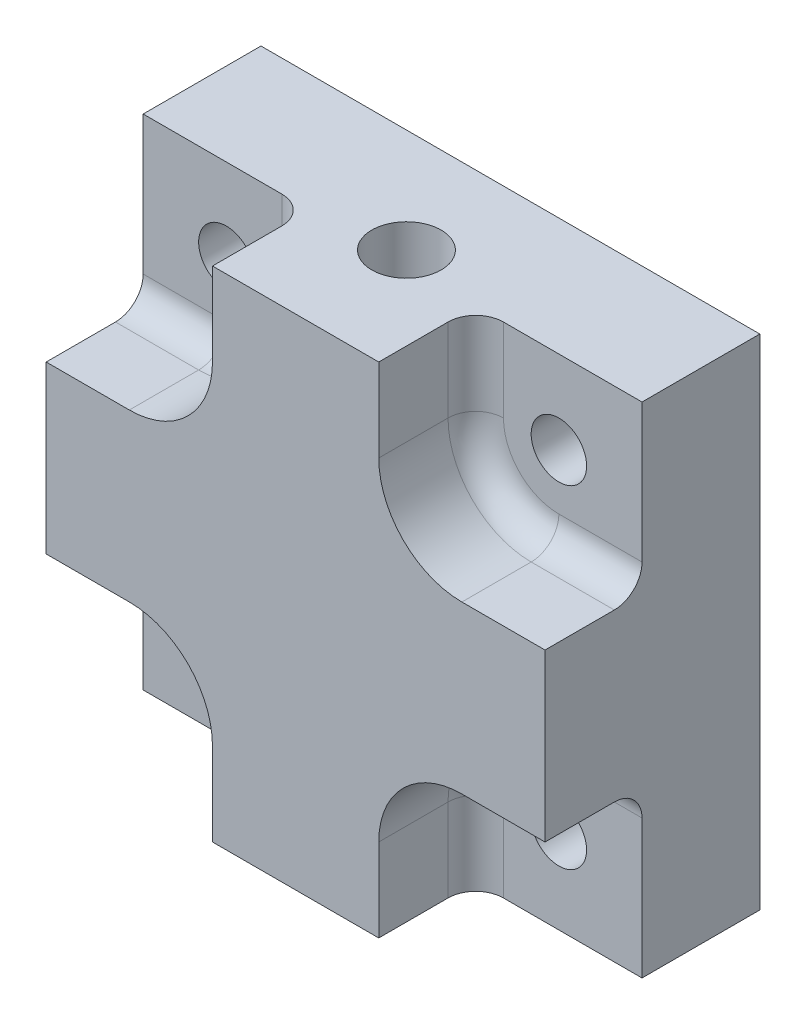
ISO-10303-21;
HEADER;
FILE_DESCRIPTION(('STEP AP214'),'2;1');
FILE_NAME('part.step','',(''),(''),'','','');
FILE_SCHEMA(('AUTOMOTIVE_DESIGN { 1 0 10303 214 1 1 1 1 }'));
ENDSEC;
DATA;
#1=APPLICATION_CONTEXT('core data for automotive mechanical design processes');
#2=APPLICATION_PROTOCOL_DEFINITION('international standard','automotive_design',2000,#1);
#3=PRODUCT_CONTEXT('',#1,'mechanical');
#4=PRODUCT('Part','Part','',(#3));
#5=PRODUCT_RELATED_PRODUCT_CATEGORY('part','',(#4));
#6=PRODUCT_DEFINITION_FORMATION('','',#4);
#7=PRODUCT_DEFINITION_CONTEXT('part definition',#1,'design');
#8=PRODUCT_DEFINITION('design','',#6,#7);
#9=PRODUCT_DEFINITION_SHAPE('','',#8);
#10=(LENGTH_UNIT() NAMED_UNIT(*) SI_UNIT(.MILLI.,.METRE.));
#11=(NAMED_UNIT(*) PLANE_ANGLE_UNIT() SI_UNIT($,.RADIAN.));
#12=(NAMED_UNIT(*) SI_UNIT($,.STERADIAN.) SOLID_ANGLE_UNIT());
#13=UNCERTAINTY_MEASURE_WITH_UNIT(LENGTH_MEASURE(1.E-05),#10,'distance_accuracy_value','');
#14=(GEOMETRIC_REPRESENTATION_CONTEXT(3) GLOBAL_UNCERTAINTY_ASSIGNED_CONTEXT((#13)) GLOBAL_UNIT_ASSIGNED_CONTEXT((#10,
#11,#12)) REPRESENTATION_CONTEXT('',''));
#15=CARTESIAN_POINT('',(0.,0.,0.));
#16=DIRECTION('',(0.,0.,1.));
#17=DIRECTION('',(1.,0.,0.));
#18=AXIS2_PLACEMENT_3D('',#15,#16,#17);
#19=CARTESIAN_POINT('',(-18.,-18.,15.5));
#20=DIRECTION('',(0.,0.,1.));
#21=DIRECTION('',(1.,0.,0.));
#22=AXIS2_PLACEMENT_3D('',#19,#20,#21);
#23=PLANE('',#22);
#24=DIRECTION('',(-1.,0.,0.));
#25=VECTOR('',#24,1.);
#26=CARTESIAN_POINT('',(12.,-6.,15.5));
#27=LINE('',#26,#25);
#28=CARTESIAN_POINT('',(18.,-6.,15.5));
#29=VERTEX_POINT('',#28);
#30=CARTESIAN_POINT('',(12.,-6.,15.5));
#31=VERTEX_POINT('',#30);
#32=EDGE_CURVE('E266',#29,#31,#27,.T.);
#33=ORIENTED_EDGE('',*,*,#32,.F.);
#34=DIRECTION('',(0.,1.,0.));
#35=VECTOR('',#34,1.);
#36=CARTESIAN_POINT('',(18.,18.,15.5));
#37=LINE('',#36,#35);
#38=CARTESIAN_POINT('',(18.,6.,15.5));
#39=VERTEX_POINT('',#38);
#40=EDGE_CURVE('E382',#29,#39,#37,.T.);
#41=ORIENTED_EDGE('',*,*,#40,.T.);
#42=DIRECTION('',(1.,0.,0.));
#43=VECTOR('',#42,1.);
#44=CARTESIAN_POINT('',(12.,6.,15.5));
#45=LINE('',#44,#43);
#46=CARTESIAN_POINT('',(12.,6.,15.5));
#47=VERTEX_POINT('',#46);
#48=EDGE_CURVE('E332',#47,#39,#45,.T.);
#49=ORIENTED_EDGE('',*,*,#48,.F.);
#50=CARTESIAN_POINT('',(12.,12.,15.5));
#51=DIRECTION('',(0.,0.,1.));
#52=DIRECTION('',(1.,0.,0.));
#53=AXIS2_PLACEMENT_3D('',#50,#51,#52);
#54=CIRCLE('',#53,6.);
#55=CARTESIAN_POINT('',(6.,12.,15.5));
#56=VERTEX_POINT('',#55);
#57=EDGE_CURVE('E329',#56,#47,#54,.T.);
#58=ORIENTED_EDGE('',*,*,#57,.F.);
#59=DIRECTION('',(0.,-1.,0.));
#60=VECTOR('',#59,1.);
#61=CARTESIAN_POINT('',(6.,12.,15.5));
#62=LINE('',#61,#60);
#63=CARTESIAN_POINT('',(6.,18.,15.5));
#64=VERTEX_POINT('',#63);
#65=EDGE_CURVE('E335',#64,#56,#62,.T.);
#66=ORIENTED_EDGE('',*,*,#65,.F.);
#67=DIRECTION('',(-1.,0.,0.));
#68=VECTOR('',#67,1.);
#69=CARTESIAN_POINT('',(-18.,18.,15.5));
#70=LINE('',#69,#68);
#71=CARTESIAN_POINT('',(-6.,18.,15.5));
#72=VERTEX_POINT('',#71);
#73=EDGE_CURVE('E385',#64,#72,#70,.T.);
#74=ORIENTED_EDGE('',*,*,#73,.T.);
#75=DIRECTION('',(0.,1.,0.));
#76=VECTOR('',#75,1.);
#77=CARTESIAN_POINT('',(-6.,12.,15.5));
#78=LINE('',#77,#76);
#79=CARTESIAN_POINT('',(-6.,12.,15.5));
#80=VERTEX_POINT('',#79);
#81=EDGE_CURVE('E309',#80,#72,#78,.T.);
#82=ORIENTED_EDGE('',*,*,#81,.F.);
#83=CARTESIAN_POINT('',(-12.,12.,15.5));
#84=DIRECTION('',(0.,0.,1.));
#85=DIRECTION('',(-1.,0.,0.));
#86=AXIS2_PLACEMENT_3D('',#83,#84,#85);
#87=CIRCLE('',#86,6.);
#88=CARTESIAN_POINT('',(-12.,6.00000000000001,15.5));
#89=VERTEX_POINT('',#88);
#90=EDGE_CURVE('E306',#89,#80,#87,.T.);
#91=ORIENTED_EDGE('',*,*,#90,.F.);
#92=DIRECTION('',(1.,0.,0.));
#93=VECTOR('',#92,1.);
#94=CARTESIAN_POINT('',(-12.,6.00000000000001,15.5));
#95=LINE('',#94,#93);
#96=CARTESIAN_POINT('',(-18.,6.00000000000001,15.5));
#97=VERTEX_POINT('',#96);
#98=EDGE_CURVE('E312',#97,#89,#95,.T.);
#99=ORIENTED_EDGE('',*,*,#98,.F.);
#100=DIRECTION('',(0.,-1.,0.));
#101=VECTOR('',#100,1.);
#102=CARTESIAN_POINT('',(-18.,18.,15.5));
#103=LINE('',#102,#101);
#104=CARTESIAN_POINT('',(-18.,-6.00000000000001,15.5));
#105=VERTEX_POINT('',#104);
#106=EDGE_CURVE('E376',#97,#105,#103,.T.);
#107=ORIENTED_EDGE('',*,*,#106,.T.);
#108=DIRECTION('',(-1.,0.,0.));
#109=VECTOR('',#108,1.);
#110=CARTESIAN_POINT('',(-12.,-6.00000000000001,15.5));
#111=LINE('',#110,#109);
#112=CARTESIAN_POINT('',(-12.,-6.00000000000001,15.5));
#113=VERTEX_POINT('',#112);
#114=EDGE_CURVE('E286',#113,#105,#111,.T.);
#115=ORIENTED_EDGE('',*,*,#114,.F.);
#116=CARTESIAN_POINT('',(-12.,-12.,15.5));
#117=DIRECTION('',(0.,0.,1.));
#118=DIRECTION('',(1.,0.,0.));
#119=AXIS2_PLACEMENT_3D('',#116,#117,#118);
#120=CIRCLE('',#119,6.);
#121=CARTESIAN_POINT('',(-6.,-12.,15.5));
#122=VERTEX_POINT('',#121);
#123=EDGE_CURVE('E283',#122,#113,#120,.T.);
#124=ORIENTED_EDGE('',*,*,#123,.F.);
#125=DIRECTION('',(0.,1.,0.));
#126=VECTOR('',#125,1.);
#127=CARTESIAN_POINT('',(-6.,-12.,15.5));
#128=LINE('',#127,#126);
#129=CARTESIAN_POINT('',(-6.,-18.,15.5));
#130=VERTEX_POINT('',#129);
#131=EDGE_CURVE('E289',#130,#122,#128,.T.);
#132=ORIENTED_EDGE('',*,*,#131,.F.);
#133=DIRECTION('',(1.,0.,0.));
#134=VECTOR('',#133,1.);
#135=CARTESIAN_POINT('',(-18.,-18.,15.5));
#136=LINE('',#135,#134);
#137=CARTESIAN_POINT('',(6.,-18.,15.5));
#138=VERTEX_POINT('',#137);
#139=EDGE_CURVE('E379',#130,#138,#136,.T.);
#140=ORIENTED_EDGE('',*,*,#139,.T.);
#141=DIRECTION('',(0.,-1.,0.));
#142=VECTOR('',#141,1.);
#143=CARTESIAN_POINT('',(6.,-12.,15.5));
#144=LINE('',#143,#142);
#145=CARTESIAN_POINT('',(6.,-12.,15.5));
#146=VERTEX_POINT('',#145);
#147=EDGE_CURVE('E263',#146,#138,#144,.T.);
#148=ORIENTED_EDGE('',*,*,#147,.F.);
#149=CARTESIAN_POINT('',(12.,-12.,15.5));
#150=DIRECTION('',(0.,0.,1.));
#151=DIRECTION('',(-1.,0.,0.));
#152=AXIS2_PLACEMENT_3D('',#149,#150,#151);
#153=CIRCLE('',#152,6.);
#154=EDGE_CURVE('E260',#31,#146,#153,.T.);
#155=ORIENTED_EDGE('',*,*,#154,.F.);
#156=EDGE_LOOP('',(#33,#41,#49,#58,#66,#74,#82,#91,#99,#107,#115,#124,#132,#140,#148,#155));
#157=FACE_BOUND('',#156,.T.);
#158=ADVANCED_FACE('F26',(#157),#23,.T.);
#159=CARTESIAN_POINT('',(-12.,-12.,0.));
#160=DIRECTION('',(0.,0.,1.));
#161=DIRECTION('',(1.,0.,0.));
#162=AXIS2_PLACEMENT_3D('',#159,#160,#161);
#163=CYLINDRICAL_SURFACE('',#162,2.);
#164=CARTESIAN_POINT('',(-12.,-12.,0.));
#165=DIRECTION('',(0.,0.,1.));
#166=DIRECTION('',(1.,0.,0.));
#167=AXIS2_PLACEMENT_3D('',#164,#165,#166);
#168=CIRCLE('',#167,2.);
#169=CARTESIAN_POINT('',(-10.,-12.,0.));
#170=VERTEX_POINT('',#169);
#171=EDGE_CURVE('E355',#170,#170,#168,.T.);
#172=ORIENTED_EDGE('',*,*,#171,.F.);
#173=EDGE_LOOP('',(#172));
#174=FACE_BOUND('',#173,.T.);
#175=CARTESIAN_POINT('',(-12.,-12.,8.5));
#176=DIRECTION('',(0.,0.,1.));
#177=DIRECTION('',(1.,0.,0.));
#178=AXIS2_PLACEMENT_3D('',#175,#176,#177);
#179=CIRCLE('',#178,2.);
#180=CARTESIAN_POINT('',(-10.,-12.,8.5));
#181=VERTEX_POINT('',#180);
#182=EDGE_CURVE('E300',#181,#181,#179,.F.);
#183=ORIENTED_EDGE('',*,*,#182,.F.);
#184=EDGE_LOOP('',(#183));
#185=FACE_BOUND('',#184,.T.);
#186=ADVANCED_FACE('F608',(#174,#185),#163,.F.);
#187=CARTESIAN_POINT('',(12.,12.,0.));
#188=DIRECTION('',(0.,0.,1.));
#189=DIRECTION('',(1.,0.,0.));
#190=AXIS2_PLACEMENT_3D('',#187,#188,#189);
#191=CYLINDRICAL_SURFACE('',#190,2.);
#192=CARTESIAN_POINT('',(12.,12.,0.));
#193=DIRECTION('',(0.,0.,1.));
#194=DIRECTION('',(1.,0.,0.));
#195=AXIS2_PLACEMENT_3D('',#192,#193,#194);
#196=CIRCLE('',#195,2.);
#197=CARTESIAN_POINT('',(14.,12.,0.));
#198=VERTEX_POINT('',#197);
#199=EDGE_CURVE('E361',#198,#198,#196,.T.);
#200=ORIENTED_EDGE('',*,*,#199,.F.);
#201=EDGE_LOOP('',(#200));
#202=FACE_BOUND('',#201,.T.);
#203=CARTESIAN_POINT('',(12.,12.,8.5));
#204=DIRECTION('',(0.,0.,1.));
#205=DIRECTION('',(1.,0.,0.));
#206=AXIS2_PLACEMENT_3D('',#203,#204,#205);
#207=CIRCLE('',#206,2.);
#208=CARTESIAN_POINT('',(14.,12.,8.5));
#209=VERTEX_POINT('',#208);
#210=EDGE_CURVE('E346',#209,#209,#207,.F.);
#211=ORIENTED_EDGE('',*,*,#210,.F.);
#212=EDGE_LOOP('',(#211));
#213=FACE_BOUND('',#212,.T.);
#214=ADVANCED_FACE('F614',(#202,#213),#191,.F.);
#215=CARTESIAN_POINT('',(-18.,18.,15.5));
#216=DIRECTION('',(1.,0.,0.));
#217=DIRECTION('',(0.,1.,0.));
#218=AXIS2_PLACEMENT_3D('',#215,#216,#217);
#219=PLANE('',#218);
#220=DIRECTION('',(0.,-1.,0.));
#221=VECTOR('',#220,1.);
#222=CARTESIAN_POINT('',(-18.,-18.,8.5));
#223=LINE('',#222,#221);
#224=CARTESIAN_POINT('',(-18.,-8.00000000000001,8.5));
#225=VERTEX_POINT('',#224);
#226=CARTESIAN_POINT('',(-18.,-18.,8.5));
#227=VERTEX_POINT('',#226);
#228=EDGE_CURVE('E292',#225,#227,#223,.T.);
#229=ORIENTED_EDGE('',*,*,#228,.F.);
#230=CARTESIAN_POINT('',(-18.,-8.00000000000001,10.5));
#231=DIRECTION('',(1.,0.,0.));
#232=DIRECTION('',(0.,1.,0.));
#233=AXIS2_PLACEMENT_3D('',#230,#231,#232);
#234=CIRCLE('',#233,2.);
#235=CARTESIAN_POINT('',(-18.,-6.00000000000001,10.5));
#236=VERTEX_POINT('',#235);
#237=EDGE_CURVE('E459',#225,#236,#234,.T.);
#238=ORIENTED_EDGE('',*,*,#237,.T.);
#239=DIRECTION('',(0.,0.,1.));
#240=VECTOR('',#239,1.);
#241=CARTESIAN_POINT('',(-18.,-6.00000000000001,8.5));
#242=LINE('',#241,#240);
#243=EDGE_CURVE('E303',#236,#105,#242,.T.);
#244=ORIENTED_EDGE('',*,*,#243,.T.);
#245=ORIENTED_EDGE('',*,*,#106,.F.);
#246=DIRECTION('',(0.,0.,1.));
#247=VECTOR('',#246,1.);
#248=CARTESIAN_POINT('',(-18.,6.00000000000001,8.5));
#249=LINE('',#248,#247);
#250=CARTESIAN_POINT('',(-18.,6.00000000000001,10.5));
#251=VERTEX_POINT('',#250);
#252=EDGE_CURVE('E324',#251,#97,#249,.T.);
#253=ORIENTED_EDGE('',*,*,#252,.F.);
#254=CARTESIAN_POINT('',(-18.,8.00000000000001,10.5));
#255=DIRECTION('',(1.,0.,0.));
#256=DIRECTION('',(0.,1.,0.));
#257=AXIS2_PLACEMENT_3D('',#254,#255,#256);
#258=CIRCLE('',#257,2.);
#259=CARTESIAN_POINT('',(-18.,8.00000000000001,8.5));
#260=VERTEX_POINT('',#259);
#261=EDGE_CURVE('E465',#251,#260,#258,.T.);
#262=ORIENTED_EDGE('',*,*,#261,.T.);
#263=DIRECTION('',(0.,-1.,0.));
#264=VECTOR('',#263,1.);
#265=CARTESIAN_POINT('',(-18.,18.,8.5));
#266=LINE('',#265,#264);
#267=CARTESIAN_POINT('',(-18.,18.,8.5));
#268=VERTEX_POINT('',#267);
#269=EDGE_CURVE('E317',#268,#260,#266,.T.);
#270=ORIENTED_EDGE('',*,*,#269,.F.);
#271=DIRECTION('',(0.,0.,-1.));
#272=VECTOR('',#271,1.);
#273=CARTESIAN_POINT('',(-18.,18.,15.5));
#274=LINE('',#273,#272);
#275=CARTESIAN_POINT('',(-18.,18.,0.));
#276=VERTEX_POINT('',#275);
#277=EDGE_CURVE('E388',#268,#276,#274,.T.);
#278=ORIENTED_EDGE('',*,*,#277,.T.);
#279=DIRECTION('',(0.,-1.,0.));
#280=VECTOR('',#279,1.);
#281=CARTESIAN_POINT('',(-18.,18.,0.));
#282=LINE('',#281,#280);
#283=CARTESIAN_POINT('',(-18.,-18.,0.));
#284=VERTEX_POINT('',#283);
#285=EDGE_CURVE('E364',#276,#284,#282,.T.);
#286=ORIENTED_EDGE('',*,*,#285,.T.);
#287=DIRECTION('',(0.,0.,-1.));
#288=VECTOR('',#287,1.);
#289=CARTESIAN_POINT('',(-18.,-18.,15.5));
#290=LINE('',#289,#288);
#291=EDGE_CURVE('E394',#227,#284,#290,.T.);
#292=ORIENTED_EDGE('',*,*,#291,.F.);
#293=EDGE_LOOP('',(#229,#238,#244,#245,#253,#262,#270,#278,#286,#292));
#294=FACE_BOUND('',#293,.T.);
#295=ADVANCED_FACE('F28',(#294),#219,.F.);
#296=CARTESIAN_POINT('',(-18.,-18.,15.5));
#297=DIRECTION('',(0.,1.,0.));
#298=DIRECTION('',(0.,0.,1.));
#299=AXIS2_PLACEMENT_3D('',#296,#297,#298);
#300=PLANE('',#299);
#301=DIRECTION('',(1.,0.,0.));
#302=VECTOR('',#301,1.);
#303=CARTESIAN_POINT('',(6.,-18.,8.5));
#304=LINE('',#303,#302);
#305=CARTESIAN_POINT('',(8.,-18.,8.5));
#306=VERTEX_POINT('',#305);
#307=CARTESIAN_POINT('',(18.,-18.,8.5));
#308=VERTEX_POINT('',#307);
#309=EDGE_CURVE('E269',#306,#308,#304,.T.);
#310=ORIENTED_EDGE('',*,*,#309,.F.);
#311=CARTESIAN_POINT('',(8.,-18.,10.5));
#312=DIRECTION('',(0.,1.,0.));
#313=DIRECTION('',(0.,0.,1.));
#314=AXIS2_PLACEMENT_3D('',#311,#312,#313);
#315=CIRCLE('',#314,2.);
#316=CARTESIAN_POINT('',(6.,-18.,10.5));
#317=VERTEX_POINT('',#316);
#318=EDGE_CURVE('E11',#306,#317,#315,.T.);
#319=ORIENTED_EDGE('',*,*,#318,.T.);
#320=DIRECTION('',(0.,0.,1.));
#321=VECTOR('',#320,1.);
#322=CARTESIAN_POINT('',(6.,-18.,8.5));
#323=LINE('',#322,#321);
#324=EDGE_CURVE('E280',#317,#138,#323,.T.);
#325=ORIENTED_EDGE('',*,*,#324,.T.);
#326=ORIENTED_EDGE('',*,*,#139,.F.);
#327=DIRECTION('',(0.,0.,1.));
#328=VECTOR('',#327,1.);
#329=CARTESIAN_POINT('',(-6.,-18.,8.5));
#330=LINE('',#329,#328);
#331=CARTESIAN_POINT('',(-6.,-18.,10.5));
#332=VERTEX_POINT('',#331);
#333=EDGE_CURVE('E301',#332,#130,#330,.T.);
#334=ORIENTED_EDGE('',*,*,#333,.F.);
#335=CARTESIAN_POINT('',(-8.,-18.,10.5));
#336=DIRECTION('',(0.,1.,0.));
#337=DIRECTION('',(0.,0.,1.));
#338=AXIS2_PLACEMENT_3D('',#335,#336,#337);
#339=CIRCLE('',#338,2.);
#340=CARTESIAN_POINT('',(-8.,-18.,8.5));
#341=VERTEX_POINT('',#340);
#342=EDGE_CURVE('E34',#332,#341,#339,.T.);
#343=ORIENTED_EDGE('',*,*,#342,.T.);
#344=DIRECTION('',(1.,0.,0.));
#345=VECTOR('',#344,1.);
#346=CARTESIAN_POINT('',(-6.,-18.,8.5));
#347=LINE('',#346,#345);
#348=EDGE_CURVE('E294',#227,#341,#347,.T.);
#349=ORIENTED_EDGE('',*,*,#348,.F.);
#350=ORIENTED_EDGE('',*,*,#291,.T.);
#351=DIRECTION('',(1.,0.,0.));
#352=VECTOR('',#351,1.);
#353=CARTESIAN_POINT('',(-18.,-18.,0.));
#354=LINE('',#353,#352);
#355=CARTESIAN_POINT('',(18.,-18.,0.));
#356=VERTEX_POINT('',#355);
#357=EDGE_CURVE('E367',#284,#356,#354,.T.);
#358=ORIENTED_EDGE('',*,*,#357,.T.);
#359=DIRECTION('',(0.,0.,-1.));
#360=VECTOR('',#359,1.);
#361=CARTESIAN_POINT('',(18.,-18.,15.5));
#362=LINE('',#361,#360);
#363=EDGE_CURVE('E392',#308,#356,#362,.T.);
#364=ORIENTED_EDGE('',*,*,#363,.F.);
#365=EDGE_LOOP('',(#310,#319,#325,#326,#334,#343,#349,#350,#358,#364));
#366=FACE_BOUND('',#365,.T.);
#367=ADVANCED_FACE('F468',(#366),#300,.F.);
#368=CARTESIAN_POINT('',(18.,18.,15.5));
#369=DIRECTION('',(-1.,0.,0.));
#370=DIRECTION('',(0.,-1.,0.));
#371=AXIS2_PLACEMENT_3D('',#368,#369,#370);
#372=PLANE('',#371);
#373=ORIENTED_EDGE('',*,*,#40,.F.);
#374=DIRECTION('',(0.,0.,1.));
#375=VECTOR('',#374,1.);
#376=CARTESIAN_POINT('',(18.,-6.,8.5));
#377=LINE('',#376,#375);
#378=CARTESIAN_POINT('',(18.,-6.,10.5));
#379=VERTEX_POINT('',#378);
#380=EDGE_CURVE('E278',#379,#29,#377,.T.);
#381=ORIENTED_EDGE('',*,*,#380,.F.);
#382=CARTESIAN_POINT('',(18.,-8.,10.5));
#383=DIRECTION('',(-1.,0.,0.));
#384=DIRECTION('',(0.,-1.,0.));
#385=AXIS2_PLACEMENT_3D('',#382,#383,#384);
#386=CIRCLE('',#385,2.);
#387=CARTESIAN_POINT('',(18.,-8.,8.5));
#388=VERTEX_POINT('',#387);
#389=EDGE_CURVE('E461',#379,#388,#386,.T.);
#390=ORIENTED_EDGE('',*,*,#389,.T.);
#391=DIRECTION('',(0.,1.,0.));
#392=VECTOR('',#391,1.);
#393=CARTESIAN_POINT('',(18.,-18.,8.5));
#394=LINE('',#393,#392);
#395=EDGE_CURVE('E271',#308,#388,#394,.T.);
#396=ORIENTED_EDGE('',*,*,#395,.F.);
#397=ORIENTED_EDGE('',*,*,#363,.T.);
#398=DIRECTION('',(0.,1.,0.));
#399=VECTOR('',#398,1.);
#400=CARTESIAN_POINT('',(18.,18.,0.));
#401=LINE('',#400,#399);
#402=CARTESIAN_POINT('',(18.,18.,0.));
#403=VERTEX_POINT('',#402);
#404=EDGE_CURVE('E370',#356,#403,#401,.T.);
#405=ORIENTED_EDGE('',*,*,#404,.T.);
#406=DIRECTION('',(0.,0.,-1.));
#407=VECTOR('',#406,1.);
#408=CARTESIAN_POINT('',(18.,18.,15.5));
#409=LINE('',#408,#407);
#410=CARTESIAN_POINT('',(18.,18.,8.5));
#411=VERTEX_POINT('',#410);
#412=EDGE_CURVE('E390',#411,#403,#409,.T.);
#413=ORIENTED_EDGE('',*,*,#412,.F.);
#414=DIRECTION('',(0.,1.,0.));
#415=VECTOR('',#414,1.);
#416=CARTESIAN_POINT('',(18.,18.,8.5));
#417=LINE('',#416,#415);
#418=CARTESIAN_POINT('',(18.,8.,8.5));
#419=VERTEX_POINT('',#418);
#420=EDGE_CURVE('E338',#419,#411,#417,.T.);
#421=ORIENTED_EDGE('',*,*,#420,.F.);
#422=CARTESIAN_POINT('',(18.,8.,10.5));
#423=DIRECTION('',(-1.,0.,0.));
#424=DIRECTION('',(0.,-1.,0.));
#425=AXIS2_PLACEMENT_3D('',#422,#423,#424);
#426=CIRCLE('',#425,2.);
#427=CARTESIAN_POINT('',(18.,6.,10.5));
#428=VERTEX_POINT('',#427);
#429=EDGE_CURVE('E463',#419,#428,#426,.T.);
#430=ORIENTED_EDGE('',*,*,#429,.T.);
#431=DIRECTION('',(0.,0.,1.));
#432=VECTOR('',#431,1.);
#433=CARTESIAN_POINT('',(18.,6.,8.5));
#434=LINE('',#433,#432);
#435=EDGE_CURVE('E349',#428,#39,#434,.T.);
#436=ORIENTED_EDGE('',*,*,#435,.T.);
#437=EDGE_LOOP('',(#373,#381,#390,#396,#397,#405,#413,#421,#430,#436));
#438=FACE_BOUND('',#437,.T.);
#439=ADVANCED_FACE('F498',(#438),#372,.F.);
#440=CARTESIAN_POINT('',(-18.,18.,15.5));
#441=DIRECTION('',(0.,-1.,0.));
#442=DIRECTION('',(0.,0.,-1.));
#443=AXIS2_PLACEMENT_3D('',#440,#441,#442);
#444=PLANE('',#443);
#445=CARTESIAN_POINT('',(0.,17.9999999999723,7.5));
#446=DIRECTION('',(0.,1.,0.));
#447=DIRECTION('',(0.,0.,1.));
#448=AXIS2_PLACEMENT_3D('',#445,#446,#447);
#449=CIRCLE('',#448,2.5);
#450=CARTESIAN_POINT('',(0.,17.9999999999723,10.));
#451=VERTEX_POINT('',#450);
#452=EDGE_CURVE('E225',#451,#451,#449,.T.);
#453=ORIENTED_EDGE('',*,*,#452,.F.);
#454=EDGE_LOOP('',(#453));
#455=FACE_BOUND('',#454,.T.);
#456=DIRECTION('',(-1.,0.,0.));
#457=VECTOR('',#456,1.);
#458=CARTESIAN_POINT('',(-6.,18.,8.5));
#459=LINE('',#458,#457);
#460=CARTESIAN_POINT('',(-8.,18.,8.5));
#461=VERTEX_POINT('',#460);
#462=EDGE_CURVE('E315',#461,#268,#459,.T.);
#463=ORIENTED_EDGE('',*,*,#462,.F.);
#464=CARTESIAN_POINT('',(-8.,18.,10.5));
#465=DIRECTION('',(0.,-1.,0.));
#466=DIRECTION('',(0.,0.,-1.));
#467=AXIS2_PLACEMENT_3D('',#464,#465,#466);
#468=CIRCLE('',#467,2.);
#469=CARTESIAN_POINT('',(-6.,18.,10.5));
#470=VERTEX_POINT('',#469);
#471=EDGE_CURVE('E457',#461,#470,#468,.T.);
#472=ORIENTED_EDGE('',*,*,#471,.T.);
#473=DIRECTION('',(0.,0.,1.));
#474=VECTOR('',#473,1.);
#475=CARTESIAN_POINT('',(-6.,18.,8.5));
#476=LINE('',#475,#474);
#477=EDGE_CURVE('E326',#470,#72,#476,.T.);
#478=ORIENTED_EDGE('',*,*,#477,.T.);
#479=ORIENTED_EDGE('',*,*,#73,.F.);
#480=DIRECTION('',(0.,0.,1.));
#481=VECTOR('',#480,1.);
#482=CARTESIAN_POINT('',(6.,18.,8.5));
#483=LINE('',#482,#481);
#484=CARTESIAN_POINT('',(6.,18.,10.5));
#485=VERTEX_POINT('',#484);
#486=EDGE_CURVE('E347',#485,#64,#483,.T.);
#487=ORIENTED_EDGE('',*,*,#486,.F.);
#488=CARTESIAN_POINT('',(8.,18.,10.5));
#489=DIRECTION('',(0.,-1.,0.));
#490=DIRECTION('',(0.,0.,-1.));
#491=AXIS2_PLACEMENT_3D('',#488,#489,#490);
#492=CIRCLE('',#491,2.);
#493=CARTESIAN_POINT('',(8.,18.,8.5));
#494=VERTEX_POINT('',#493);
#495=EDGE_CURVE('E455',#485,#494,#492,.T.);
#496=ORIENTED_EDGE('',*,*,#495,.T.);
#497=DIRECTION('',(-1.,0.,0.));
#498=VECTOR('',#497,1.);
#499=CARTESIAN_POINT('',(6.,18.,8.5));
#500=LINE('',#499,#498);
#501=EDGE_CURVE('E340',#411,#494,#500,.T.);
#502=ORIENTED_EDGE('',*,*,#501,.F.);
#503=ORIENTED_EDGE('',*,*,#412,.T.);
#504=DIRECTION('',(-1.,0.,0.));
#505=VECTOR('',#504,1.);
#506=CARTESIAN_POINT('',(-18.,18.,0.));
#507=LINE('',#506,#505);
#508=EDGE_CURVE('E373',#403,#276,#507,.T.);
#509=ORIENTED_EDGE('',*,*,#508,.T.);
#510=ORIENTED_EDGE('',*,*,#277,.F.);
#511=EDGE_LOOP('',(#463,#472,#478,#479,#487,#496,#502,#503,#509,#510));
#512=FACE_BOUND('',#511,.T.);
#513=ADVANCED_FACE('F556',(#455,#512),#444,.F.);
#514=CARTESIAN_POINT('',(-18.,-18.,0.));
#515=DIRECTION('',(0.,0.,1.));
#516=DIRECTION('',(1.,0.,0.));
#517=AXIS2_PLACEMENT_3D('',#514,#515,#516);
#518=PLANE('',#517);
#519=CARTESIAN_POINT('',(0.,0.,0.));
#520=DIRECTION('',(0.,0.,-1.));
#521=DIRECTION('',(-1.,0.,0.));
#522=AXIS2_PLACEMENT_3D('',#519,#520,#521);
#523=CIRCLE('',#522,14.5);
#524=CARTESIAN_POINT('',(-14.5,0.,0.));
#525=VERTEX_POINT('',#524);
#526=EDGE_CURVE('E915',#525,#525,#523,.T.);
#527=ORIENTED_EDGE('',*,*,#526,.F.);
#528=EDGE_LOOP('',(#527));
#529=FACE_BOUND('',#528,.T.);
#530=CARTESIAN_POINT('',(12.,-12.,0.));
#531=DIRECTION('',(0.,0.,1.));
#532=DIRECTION('',(-1.,0.,0.));
#533=AXIS2_PLACEMENT_3D('',#530,#531,#532);
#534=CIRCLE('',#533,2.);
#535=CARTESIAN_POINT('',(10.,-12.,0.));
#536=VERTEX_POINT('',#535);
#537=EDGE_CURVE('E352',#536,#536,#534,.T.);
#538=ORIENTED_EDGE('',*,*,#537,.T.);
#539=EDGE_LOOP('',(#538));
#540=FACE_BOUND('',#539,.T.);
#541=ORIENTED_EDGE('',*,*,#171,.T.);
#542=EDGE_LOOP('',(#541));
#543=FACE_BOUND('',#542,.T.);
#544=CARTESIAN_POINT('',(-12.,12.,0.));
#545=DIRECTION('',(0.,0.,1.));
#546=DIRECTION('',(-1.,0.,0.));
#547=AXIS2_PLACEMENT_3D('',#544,#545,#546);
#548=CIRCLE('',#547,2.);
#549=CARTESIAN_POINT('',(-14.,12.,0.));
#550=VERTEX_POINT('',#549);
#551=EDGE_CURVE('E358',#550,#550,#548,.T.);
#552=ORIENTED_EDGE('',*,*,#551,.T.);
#553=EDGE_LOOP('',(#552));
#554=FACE_BOUND('',#553,.T.);
#555=ORIENTED_EDGE('',*,*,#199,.T.);
#556=EDGE_LOOP('',(#555));
#557=FACE_BOUND('',#556,.T.);
#558=ORIENTED_EDGE('',*,*,#285,.F.);
#559=ORIENTED_EDGE('',*,*,#508,.F.);
#560=ORIENTED_EDGE('',*,*,#404,.F.);
#561=ORIENTED_EDGE('',*,*,#357,.F.);
#562=EDGE_LOOP('',(#558,#559,#560,#561));
#563=FACE_BOUND('',#562,.T.);
#564=ADVANCED_FACE('F493',(#529,#540,#543,#554,#557,#563),#518,.F.);
#565=CARTESIAN_POINT('',(-12.,12.,0.));
#566=DIRECTION('',(0.,0.,1.));
#567=DIRECTION('',(1.,0.,0.));
#568=AXIS2_PLACEMENT_3D('',#565,#566,#567);
#569=CYLINDRICAL_SURFACE('',#568,2.);
#570=CARTESIAN_POINT('',(-12.,12.,8.5));
#571=DIRECTION('',(0.,0.,-1.));
#572=DIRECTION('',(-1.,0.,0.));
#573=AXIS2_PLACEMENT_3D('',#570,#571,#572);
#574=CIRCLE('',#573,2.);
#575=CARTESIAN_POINT('',(-14.,12.,8.5));
#576=VERTEX_POINT('',#575);
#577=EDGE_CURVE('E323',#576,#576,#574,.F.);
#578=ORIENTED_EDGE('',*,*,#577,.T.);
#579=EDGE_LOOP('',(#578));
#580=FACE_BOUND('',#579,.T.);
#581=ORIENTED_EDGE('',*,*,#551,.F.);
#582=EDGE_LOOP('',(#581));
#583=FACE_BOUND('',#582,.T.);
#584=ADVANCED_FACE('F639',(#580,#583),#569,.F.);
#585=CARTESIAN_POINT('',(12.,-12.,0.));
#586=DIRECTION('',(0.,0.,1.));
#587=DIRECTION('',(1.,0.,0.));
#588=AXIS2_PLACEMENT_3D('',#585,#586,#587);
#589=CYLINDRICAL_SURFACE('',#588,2.);
#590=CARTESIAN_POINT('',(12.,-12.,8.5));
#591=DIRECTION('',(0.,0.,-1.));
#592=DIRECTION('',(-1.,0.,0.));
#593=AXIS2_PLACEMENT_3D('',#590,#591,#592);
#594=CIRCLE('',#593,2.);
#595=CARTESIAN_POINT('',(10.,-12.,8.5));
#596=VERTEX_POINT('',#595);
#597=EDGE_CURVE('E277',#596,#596,#594,.F.);
#598=ORIENTED_EDGE('',*,*,#597,.T.);
#599=EDGE_LOOP('',(#598));
#600=FACE_BOUND('',#599,.T.);
#601=ORIENTED_EDGE('',*,*,#537,.F.);
#602=EDGE_LOOP('',(#601));
#603=FACE_BOUND('',#602,.T.);
#604=ADVANCED_FACE('F640',(#600,#603),#589,.F.);
#605=CARTESIAN_POINT('',(12.,12.,8.5));
#606=DIRECTION('',(0.,0.,1.));
#607=DIRECTION('',(1.,0.,0.));
#608=AXIS2_PLACEMENT_3D('',#605,#606,#607);
#609=PLANE('',#608);
#610=ORIENTED_EDGE('',*,*,#501,.T.);
#611=DIRECTION('',(0.,-1.,0.));
#612=VECTOR('',#611,1.);
#613=CARTESIAN_POINT('',(8.,12.,8.5));
#614=LINE('',#613,#612);
#615=CARTESIAN_POINT('',(8.,12.,8.5));
#616=VERTEX_POINT('',#615);
#617=EDGE_CURVE('E408',#494,#616,#614,.T.);
#618=ORIENTED_EDGE('',*,*,#617,.T.);
#619=CARTESIAN_POINT('',(12.,12.,8.5));
#620=DIRECTION('',(0.,0.,1.));
#621=DIRECTION('',(1.,0.,0.));
#622=AXIS2_PLACEMENT_3D('',#619,#620,#621);
#623=CIRCLE('',#622,4.);
#624=CARTESIAN_POINT('',(12.,8.,8.5));
#625=VERTEX_POINT('',#624);
#626=EDGE_CURVE('E406',#616,#625,#623,.T.);
#627=ORIENTED_EDGE('',*,*,#626,.T.);
#628=DIRECTION('',(1.,0.,0.));
#629=VECTOR('',#628,1.);
#630=CARTESIAN_POINT('',(12.,8.,8.5));
#631=LINE('',#630,#629);
#632=EDGE_CURVE('E396',#625,#419,#631,.T.);
#633=ORIENTED_EDGE('',*,*,#632,.T.);
#634=ORIENTED_EDGE('',*,*,#420,.T.);
#635=EDGE_LOOP('',(#610,#618,#627,#633,#634));
#636=FACE_BOUND('',#635,.T.);
#637=ORIENTED_EDGE('',*,*,#210,.T.);
#638=EDGE_LOOP('',(#637));
#639=FACE_BOUND('',#638,.T.);
#640=ADVANCED_FACE('F562',(#636,#639),#609,.T.);
#641=CARTESIAN_POINT('',(12.,12.,8.5));
#642=DIRECTION('',(0.,0.,1.));
#643=DIRECTION('',(1.,0.,0.));
#644=AXIS2_PLACEMENT_3D('',#641,#642,#643);
#645=CYLINDRICAL_SURFACE('',#644,6.);
#646=DIRECTION('',(0.,0.,1.));
#647=VECTOR('',#646,1.);
#648=CARTESIAN_POINT('',(12.,6.,8.5));
#649=LINE('',#648,#647);
#650=CARTESIAN_POINT('',(12.,6.,10.5));
#651=VERTEX_POINT('',#650);
#652=EDGE_CURVE('E343',#651,#47,#649,.T.);
#653=ORIENTED_EDGE('',*,*,#652,.F.);
#654=CARTESIAN_POINT('',(12.,12.,10.5));
#655=DIRECTION('',(0.,0.,1.));
#656=DIRECTION('',(1.,0.,0.));
#657=AXIS2_PLACEMENT_3D('',#654,#655,#656);
#658=CIRCLE('',#657,6.);
#659=CARTESIAN_POINT('',(6.,12.,10.5));
#660=VERTEX_POINT('',#659);
#661=EDGE_CURVE('E440',#651,#660,#658,.F.);
#662=ORIENTED_EDGE('',*,*,#661,.T.);
#663=DIRECTION('',(0.,0.,1.));
#664=VECTOR('',#663,1.);
#665=CARTESIAN_POINT('',(6.,12.,8.5));
#666=LINE('',#665,#664);
#667=EDGE_CURVE('E344',#660,#56,#666,.T.);
#668=ORIENTED_EDGE('',*,*,#667,.T.);
#669=ORIENTED_EDGE('',*,*,#57,.T.);
#670=EDGE_LOOP('',(#653,#662,#668,#669));
#671=FACE_BOUND('',#670,.T.);
#672=ADVANCED_FACE('F645',(#671),#645,.F.);
#673=CARTESIAN_POINT('',(6.,12.,8.5));
#674=DIRECTION('',(-1.,0.,0.));
#675=DIRECTION('',(0.,0.,1.));
#676=AXIS2_PLACEMENT_3D('',#673,#674,#675);
#677=PLANE('',#676);
#678=ORIENTED_EDGE('',*,*,#667,.F.);
#679=DIRECTION('',(0.,-1.,0.));
#680=VECTOR('',#679,1.);
#681=CARTESIAN_POINT('',(6.,12.,10.5));
#682=LINE('',#681,#680);
#683=EDGE_CURVE('E411',#660,#485,#682,.F.);
#684=ORIENTED_EDGE('',*,*,#683,.T.);
#685=ORIENTED_EDGE('',*,*,#486,.T.);
#686=ORIENTED_EDGE('',*,*,#65,.T.);
#687=EDGE_LOOP('',(#678,#684,#685,#686));
#688=FACE_BOUND('',#687,.T.);
#689=ADVANCED_FACE('F648',(#688),#677,.F.);
#690=CARTESIAN_POINT('',(12.,6.,8.5));
#691=DIRECTION('',(0.,-1.,0.));
#692=DIRECTION('',(1.,0.,0.));
#693=AXIS2_PLACEMENT_3D('',#690,#691,#692);
#694=PLANE('',#693);
#695=ORIENTED_EDGE('',*,*,#435,.F.);
#696=DIRECTION('',(1.,0.,0.));
#697=VECTOR('',#696,1.);
#698=CARTESIAN_POINT('',(12.,6.,10.5));
#699=LINE('',#698,#697);
#700=EDGE_CURVE('E448',#428,#651,#699,.F.);
#701=ORIENTED_EDGE('',*,*,#700,.T.);
#702=ORIENTED_EDGE('',*,*,#652,.T.);
#703=ORIENTED_EDGE('',*,*,#48,.T.);
#704=EDGE_LOOP('',(#695,#701,#702,#703));
#705=FACE_BOUND('',#704,.T.);
#706=ADVANCED_FACE('F580',(#705),#694,.F.);
#707=CARTESIAN_POINT('',(-12.,12.,8.5));
#708=DIRECTION('',(0.,0.,-1.));
#709=DIRECTION('',(-1.,0.,0.));
#710=AXIS2_PLACEMENT_3D('',#707,#708,#709);
#711=PLANE('',#710);
#712=CARTESIAN_POINT('',(-12.,12.,8.5));
#713=DIRECTION('',(0.,0.,-1.));
#714=DIRECTION('',(-1.,0.,0.));
#715=AXIS2_PLACEMENT_3D('',#712,#713,#714);
#716=CIRCLE('',#715,4.);
#717=CARTESIAN_POINT('',(-12.,8.00000000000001,8.5));
#718=VERTEX_POINT('',#717);
#719=CARTESIAN_POINT('',(-8.,12.,8.5));
#720=VERTEX_POINT('',#719);
#721=EDGE_CURVE('E415',#718,#720,#716,.F.);
#722=ORIENTED_EDGE('',*,*,#721,.T.);
#723=DIRECTION('',(0.,1.,0.));
#724=VECTOR('',#723,1.);
#725=CARTESIAN_POINT('',(-8.,18.,8.5));
#726=LINE('',#725,#724);
#727=EDGE_CURVE('E417',#720,#461,#726,.T.);
#728=ORIENTED_EDGE('',*,*,#727,.T.);
#729=ORIENTED_EDGE('',*,*,#462,.T.);
#730=ORIENTED_EDGE('',*,*,#269,.T.);
#731=DIRECTION('',(1.,0.,0.));
#732=VECTOR('',#731,1.);
#733=CARTESIAN_POINT('',(-12.,8.00000000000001,8.5));
#734=LINE('',#733,#732);
#735=EDGE_CURVE('E413',#260,#718,#734,.T.);
#736=ORIENTED_EDGE('',*,*,#735,.T.);
#737=EDGE_LOOP('',(#722,#728,#729,#730,#736));
#738=FACE_BOUND('',#737,.T.);
#739=ORIENTED_EDGE('',*,*,#577,.F.);
#740=EDGE_LOOP('',(#739));
#741=FACE_BOUND('',#740,.T.);
#742=ADVANCED_FACE('F550',(#738,#741),#711,.F.);
#743=CARTESIAN_POINT('',(-12.,12.,8.5));
#744=DIRECTION('',(0.,0.,1.));
#745=DIRECTION('',(1.,0.,0.));
#746=AXIS2_PLACEMENT_3D('',#743,#744,#745);
#747=CYLINDRICAL_SURFACE('',#746,6.);
#748=DIRECTION('',(0.,0.,1.));
#749=VECTOR('',#748,1.);
#750=CARTESIAN_POINT('',(-6.,12.,8.5));
#751=LINE('',#750,#749);
#752=CARTESIAN_POINT('',(-6.,12.,10.5));
#753=VERTEX_POINT('',#752);
#754=EDGE_CURVE('E320',#753,#80,#751,.T.);
#755=ORIENTED_EDGE('',*,*,#754,.F.);
#756=CARTESIAN_POINT('',(-12.,12.,10.5));
#757=DIRECTION('',(0.,0.,-1.));
#758=DIRECTION('',(-1.,0.,0.));
#759=AXIS2_PLACEMENT_3D('',#756,#757,#758);
#760=CIRCLE('',#759,6.);
#761=CARTESIAN_POINT('',(-12.,6.00000000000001,10.5));
#762=VERTEX_POINT('',#761);
#763=EDGE_CURVE('E442',#753,#762,#760,.T.);
#764=ORIENTED_EDGE('',*,*,#763,.T.);
#765=DIRECTION('',(0.,0.,1.));
#766=VECTOR('',#765,1.);
#767=CARTESIAN_POINT('',(-12.,6.00000000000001,8.5));
#768=LINE('',#767,#766);
#769=EDGE_CURVE('E321',#762,#89,#768,.T.);
#770=ORIENTED_EDGE('',*,*,#769,.T.);
#771=ORIENTED_EDGE('',*,*,#90,.T.);
#772=EDGE_LOOP('',(#755,#764,#770,#771));
#773=FACE_BOUND('',#772,.T.);
#774=ADVANCED_FACE('F657',(#773),#747,.F.);
#775=CARTESIAN_POINT('',(-12.,6.00000000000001,8.5));
#776=DIRECTION('',(0.,-1.,0.));
#777=DIRECTION('',(1.,0.,0.));
#778=AXIS2_PLACEMENT_3D('',#775,#776,#777);
#779=PLANE('',#778);
#780=ORIENTED_EDGE('',*,*,#769,.F.);
#781=DIRECTION('',(1.,0.,0.));
#782=VECTOR('',#781,1.);
#783=CARTESIAN_POINT('',(-18.,6.00000000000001,10.5));
#784=LINE('',#783,#782);
#785=EDGE_CURVE('E450',#762,#251,#784,.F.);
#786=ORIENTED_EDGE('',*,*,#785,.T.);
#787=ORIENTED_EDGE('',*,*,#252,.T.);
#788=ORIENTED_EDGE('',*,*,#98,.T.);
#789=EDGE_LOOP('',(#780,#786,#787,#788));
#790=FACE_BOUND('',#789,.T.);
#791=ADVANCED_FACE('F537',(#790),#779,.F.);
#792=CARTESIAN_POINT('',(-6.,12.,8.5));
#793=DIRECTION('',(1.,0.,0.));
#794=DIRECTION('',(0.,0.,-1.));
#795=AXIS2_PLACEMENT_3D('',#792,#793,#794);
#796=PLANE('',#795);
#797=ORIENTED_EDGE('',*,*,#477,.F.);
#798=DIRECTION('',(0.,1.,0.));
#799=VECTOR('',#798,1.);
#800=CARTESIAN_POINT('',(-6.,12.,10.5));
#801=LINE('',#800,#799);
#802=EDGE_CURVE('E420',#470,#753,#801,.F.);
#803=ORIENTED_EDGE('',*,*,#802,.T.);
#804=ORIENTED_EDGE('',*,*,#754,.T.);
#805=ORIENTED_EDGE('',*,*,#81,.T.);
#806=EDGE_LOOP('',(#797,#803,#804,#805));
#807=FACE_BOUND('',#806,.T.);
#808=ADVANCED_FACE('F661',(#807),#796,.F.);
#809=CARTESIAN_POINT('',(-12.,-12.,8.5));
#810=DIRECTION('',(0.,0.,1.));
#811=DIRECTION('',(1.,0.,0.));
#812=AXIS2_PLACEMENT_3D('',#809,#810,#811);
#813=PLANE('',#812);
#814=CARTESIAN_POINT('',(-12.,-12.,8.5));
#815=DIRECTION('',(0.,0.,1.));
#816=DIRECTION('',(1.,0.,0.));
#817=AXIS2_PLACEMENT_3D('',#814,#815,#816);
#818=CIRCLE('',#817,4.);
#819=CARTESIAN_POINT('',(-8.,-12.,8.5));
#820=VERTEX_POINT('',#819);
#821=CARTESIAN_POINT('',(-12.,-8.00000000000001,8.5));
#822=VERTEX_POINT('',#821);
#823=EDGE_CURVE('E424',#820,#822,#818,.T.);
#824=ORIENTED_EDGE('',*,*,#823,.T.);
#825=DIRECTION('',(-1.,0.,0.));
#826=VECTOR('',#825,1.);
#827=CARTESIAN_POINT('',(-12.,-8.00000000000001,8.5));
#828=LINE('',#827,#826);
#829=EDGE_CURVE('E426',#822,#225,#828,.T.);
#830=ORIENTED_EDGE('',*,*,#829,.T.);
#831=ORIENTED_EDGE('',*,*,#228,.T.);
#832=ORIENTED_EDGE('',*,*,#348,.T.);
#833=DIRECTION('',(0.,1.,0.));
#834=VECTOR('',#833,1.);
#835=CARTESIAN_POINT('',(-8.,-12.,8.5));
#836=LINE('',#835,#834);
#837=EDGE_CURVE('E422',#341,#820,#836,.T.);
#838=ORIENTED_EDGE('',*,*,#837,.T.);
#839=EDGE_LOOP('',(#824,#830,#831,#832,#838));
#840=FACE_BOUND('',#839,.T.);
#841=ORIENTED_EDGE('',*,*,#182,.T.);
#842=EDGE_LOOP('',(#841));
#843=FACE_BOUND('',#842,.T.);
#844=ADVANCED_FACE('F474',(#840,#843),#813,.T.);
#845=CARTESIAN_POINT('',(-12.,-12.,8.5));
#846=DIRECTION('',(0.,0.,1.));
#847=DIRECTION('',(1.,0.,0.));
#848=AXIS2_PLACEMENT_3D('',#845,#846,#847);
#849=CYLINDRICAL_SURFACE('',#848,6.);
#850=DIRECTION('',(0.,0.,1.));
#851=VECTOR('',#850,1.);
#852=CARTESIAN_POINT('',(-12.,-6.00000000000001,8.5));
#853=LINE('',#852,#851);
#854=CARTESIAN_POINT('',(-12.,-6.00000000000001,10.5));
#855=VERTEX_POINT('',#854);
#856=EDGE_CURVE('E297',#855,#113,#853,.T.);
#857=ORIENTED_EDGE('',*,*,#856,.F.);
#858=CARTESIAN_POINT('',(-12.,-12.,10.5));
#859=DIRECTION('',(0.,0.,1.));
#860=DIRECTION('',(1.,0.,0.));
#861=AXIS2_PLACEMENT_3D('',#858,#859,#860);
#862=CIRCLE('',#861,6.);
#863=CARTESIAN_POINT('',(-6.,-12.,10.5));
#864=VERTEX_POINT('',#863);
#865=EDGE_CURVE('E444',#855,#864,#862,.F.);
#866=ORIENTED_EDGE('',*,*,#865,.T.);
#867=DIRECTION('',(0.,0.,1.));
#868=VECTOR('',#867,1.);
#869=CARTESIAN_POINT('',(-6.,-12.,8.5));
#870=LINE('',#869,#868);
#871=EDGE_CURVE('E298',#864,#122,#870,.T.);
#872=ORIENTED_EDGE('',*,*,#871,.T.);
#873=ORIENTED_EDGE('',*,*,#123,.T.);
#874=EDGE_LOOP('',(#857,#866,#872,#873));
#875=FACE_BOUND('',#874,.T.);
#876=ADVANCED_FACE('F524',(#875),#849,.F.);
#877=CARTESIAN_POINT('',(-6.,-12.,8.5));
#878=DIRECTION('',(1.,0.,0.));
#879=DIRECTION('',(0.,0.,-1.));
#880=AXIS2_PLACEMENT_3D('',#877,#878,#879);
#881=PLANE('',#880);
#882=ORIENTED_EDGE('',*,*,#871,.F.);
#883=DIRECTION('',(0.,1.,0.));
#884=VECTOR('',#883,1.);
#885=CARTESIAN_POINT('',(-6.,-12.,10.5));
#886=LINE('',#885,#884);
#887=EDGE_CURVE('E47',#864,#332,#886,.F.);
#888=ORIENTED_EDGE('',*,*,#887,.T.);
#889=ORIENTED_EDGE('',*,*,#333,.T.);
#890=ORIENTED_EDGE('',*,*,#131,.T.);
#891=EDGE_LOOP('',(#882,#888,#889,#890));
#892=FACE_BOUND('',#891,.T.);
#893=ADVANCED_FACE('F521',(#892),#881,.F.);
#894=CARTESIAN_POINT('',(-12.,-6.00000000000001,8.5));
#895=DIRECTION('',(0.,1.,0.));
#896=DIRECTION('',(-1.,0.,0.));
#897=AXIS2_PLACEMENT_3D('',#894,#895,#896);
#898=PLANE('',#897);
#899=ORIENTED_EDGE('',*,*,#243,.F.);
#900=DIRECTION('',(-1.,0.,0.));
#901=VECTOR('',#900,1.);
#902=CARTESIAN_POINT('',(-12.,-6.00000000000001,10.5));
#903=LINE('',#902,#901);
#904=EDGE_CURVE('E429',#236,#855,#903,.F.);
#905=ORIENTED_EDGE('',*,*,#904,.T.);
#906=ORIENTED_EDGE('',*,*,#856,.T.);
#907=ORIENTED_EDGE('',*,*,#114,.T.);
#908=EDGE_LOOP('',(#899,#905,#906,#907));
#909=FACE_BOUND('',#908,.T.);
#910=ADVANCED_FACE('F528',(#909),#898,.F.);
#911=CARTESIAN_POINT('',(12.,-12.,8.5));
#912=DIRECTION('',(0.,0.,-1.));
#913=DIRECTION('',(-1.,0.,0.));
#914=AXIS2_PLACEMENT_3D('',#911,#912,#913);
#915=PLANE('',#914);
#916=ORIENTED_EDGE('',*,*,#395,.T.);
#917=DIRECTION('',(-1.,0.,0.));
#918=VECTOR('',#917,1.);
#919=CARTESIAN_POINT('',(12.,-8.,8.5));
#920=LINE('',#919,#918);
#921=CARTESIAN_POINT('',(12.,-8.,8.5));
#922=VERTEX_POINT('',#921);
#923=EDGE_CURVE('E435',#388,#922,#920,.T.);
#924=ORIENTED_EDGE('',*,*,#923,.T.);
#925=CARTESIAN_POINT('',(12.,-12.,8.5));
#926=DIRECTION('',(0.,0.,-1.));
#927=DIRECTION('',(-1.,0.,0.));
#928=AXIS2_PLACEMENT_3D('',#925,#926,#927);
#929=CIRCLE('',#928,4.);
#930=CARTESIAN_POINT('',(8.,-12.,8.5));
#931=VERTEX_POINT('',#930);
#932=EDGE_CURVE('E433',#922,#931,#929,.F.);
#933=ORIENTED_EDGE('',*,*,#932,.T.);
#934=DIRECTION('',(0.,-1.,0.));
#935=VECTOR('',#934,1.);
#936=CARTESIAN_POINT('',(8.,-18.,8.5));
#937=LINE('',#936,#935);
#938=EDGE_CURVE('E431',#931,#306,#937,.T.);
#939=ORIENTED_EDGE('',*,*,#938,.T.);
#940=ORIENTED_EDGE('',*,*,#309,.T.);
#941=EDGE_LOOP('',(#916,#924,#933,#939,#940));
#942=FACE_BOUND('',#941,.T.);
#943=ORIENTED_EDGE('',*,*,#597,.F.);
#944=EDGE_LOOP('',(#943));
#945=FACE_BOUND('',#944,.T.);
#946=ADVANCED_FACE('F594',(#942,#945),#915,.F.);
#947=CARTESIAN_POINT('',(12.,-12.,8.5));
#948=DIRECTION('',(0.,0.,1.));
#949=DIRECTION('',(1.,0.,0.));
#950=AXIS2_PLACEMENT_3D('',#947,#948,#949);
#951=CYLINDRICAL_SURFACE('',#950,6.);
#952=DIRECTION('',(0.,0.,1.));
#953=VECTOR('',#952,1.);
#954=CARTESIAN_POINT('',(6.,-12.,8.5));
#955=LINE('',#954,#953);
#956=CARTESIAN_POINT('',(6.,-12.,10.5));
#957=VERTEX_POINT('',#956);
#958=EDGE_CURVE('E274',#957,#146,#955,.T.);
#959=ORIENTED_EDGE('',*,*,#958,.F.);
#960=CARTESIAN_POINT('',(12.,-12.,10.5));
#961=DIRECTION('',(0.,0.,-1.));
#962=DIRECTION('',(-1.,0.,0.));
#963=AXIS2_PLACEMENT_3D('',#960,#961,#962);
#964=CIRCLE('',#963,6.);
#965=CARTESIAN_POINT('',(12.,-6.,10.5));
#966=VERTEX_POINT('',#965);
#967=EDGE_CURVE('E446',#957,#966,#964,.T.);
#968=ORIENTED_EDGE('',*,*,#967,.T.);
#969=DIRECTION('',(0.,0.,1.));
#970=VECTOR('',#969,1.);
#971=CARTESIAN_POINT('',(12.,-6.,8.5));
#972=LINE('',#971,#970);
#973=EDGE_CURVE('E275',#966,#31,#972,.T.);
#974=ORIENTED_EDGE('',*,*,#973,.T.);
#975=ORIENTED_EDGE('',*,*,#154,.T.);
#976=EDGE_LOOP('',(#959,#968,#974,#975));
#977=FACE_BOUND('',#976,.T.);
#978=ADVANCED_FACE('F512',(#977),#951,.F.);
#979=CARTESIAN_POINT('',(12.,-6.,8.5));
#980=DIRECTION('',(0.,1.,0.));
#981=DIRECTION('',(-1.,0.,0.));
#982=AXIS2_PLACEMENT_3D('',#979,#980,#981);
#983=PLANE('',#982);
#984=ORIENTED_EDGE('',*,*,#973,.F.);
#985=DIRECTION('',(-1.,0.,0.));
#986=VECTOR('',#985,1.);
#987=CARTESIAN_POINT('',(18.,-6.,10.5));
#988=LINE('',#987,#986);
#989=EDGE_CURVE('E438',#966,#379,#988,.F.);
#990=ORIENTED_EDGE('',*,*,#989,.T.);
#991=ORIENTED_EDGE('',*,*,#380,.T.);
#992=ORIENTED_EDGE('',*,*,#32,.T.);
#993=EDGE_LOOP('',(#984,#990,#991,#992));
#994=FACE_BOUND('',#993,.T.);
#995=ADVANCED_FACE('F679',(#994),#983,.F.);
#996=CARTESIAN_POINT('',(6.,-12.,8.5));
#997=DIRECTION('',(-1.,0.,0.));
#998=DIRECTION('',(0.,0.,1.));
#999=AXIS2_PLACEMENT_3D('',#996,#997,#998);
#1000=PLANE('',#999);
#1001=ORIENTED_EDGE('',*,*,#324,.F.);
#1002=DIRECTION('',(0.,-1.,0.));
#1003=VECTOR('',#1002,1.);
#1004=CARTESIAN_POINT('',(6.,-12.,10.5));
#1005=LINE('',#1004,#1003);
#1006=EDGE_CURVE('E453',#317,#957,#1005,.F.);
#1007=ORIENTED_EDGE('',*,*,#1006,.T.);
#1008=ORIENTED_EDGE('',*,*,#958,.T.);
#1009=ORIENTED_EDGE('',*,*,#147,.T.);
#1010=EDGE_LOOP('',(#1001,#1007,#1008,#1009));
#1011=FACE_BOUND('',#1010,.T.);
#1012=ADVANCED_FACE('F510',(#1011),#1000,.F.);
#1013=CARTESIAN_POINT('',(12.,8.,10.5));
#1014=DIRECTION('',(1.,0.,0.));
#1015=DIRECTION('',(0.,1.,0.));
#1016=AXIS2_PLACEMENT_3D('',#1013,#1014,#1015);
#1017=CYLINDRICAL_SURFACE('',#1016,2.);
#1018=ORIENTED_EDGE('',*,*,#429,.F.);
#1019=ORIENTED_EDGE('',*,*,#632,.F.);
#1020=CARTESIAN_POINT('',(12.,8.,10.5));
#1021=DIRECTION('',(1.,0.,0.));
#1022=DIRECTION('',(0.,0.,-1.));
#1023=AXIS2_PLACEMENT_3D('',#1020,#1021,#1022);
#1024=CIRCLE('',#1023,2.);
#1025=EDGE_CURVE('E257',#651,#625,#1024,.T.);
#1026=ORIENTED_EDGE('',*,*,#1025,.F.);
#1027=ORIENTED_EDGE('',*,*,#700,.F.);
#1028=EDGE_LOOP('',(#1018,#1019,#1026,#1027));
#1029=FACE_BOUND('',#1028,.T.);
#1030=ADVANCED_FACE('F576',(#1029),#1017,.F.);
#1031=CARTESIAN_POINT('',(12.,12.,10.5));
#1032=DIRECTION('',(0.,0.,1.));
#1033=DIRECTION('',(1.,0.,0.));
#1034=AXIS2_PLACEMENT_3D('',#1031,#1032,#1033);
#1035=TOROIDAL_SURFACE('',#1034,4.,2.);
#1036=ORIENTED_EDGE('',*,*,#1025,.T.);
#1037=ORIENTED_EDGE('',*,*,#626,.F.);
#1038=CARTESIAN_POINT('',(8.,12.,10.5));
#1039=DIRECTION('',(0.,-1.,0.));
#1040=DIRECTION('',(0.,0.,-1.));
#1041=AXIS2_PLACEMENT_3D('',#1038,#1039,#1040);
#1042=CIRCLE('',#1041,2.);
#1043=EDGE_CURVE('E255',#660,#616,#1042,.T.);
#1044=ORIENTED_EDGE('',*,*,#1043,.F.);
#1045=ORIENTED_EDGE('',*,*,#661,.F.);
#1046=EDGE_LOOP('',(#1036,#1037,#1044,#1045));
#1047=FACE_BOUND('',#1046,.T.);
#1048=ADVANCED_FACE('F571',(#1047),#1035,.F.);
#1049=CARTESIAN_POINT('',(8.,12.,10.5));
#1050=DIRECTION('',(0.,-1.,0.));
#1051=DIRECTION('',(0.,0.,-1.));
#1052=AXIS2_PLACEMENT_3D('',#1049,#1050,#1051);
#1053=CYLINDRICAL_SURFACE('',#1052,2.);
#1054=ORIENTED_EDGE('',*,*,#495,.F.);
#1055=ORIENTED_EDGE('',*,*,#683,.F.);
#1056=ORIENTED_EDGE('',*,*,#1043,.T.);
#1057=ORIENTED_EDGE('',*,*,#617,.F.);
#1058=EDGE_LOOP('',(#1054,#1055,#1056,#1057));
#1059=FACE_BOUND('',#1058,.T.);
#1060=ADVANCED_FACE('F565',(#1059),#1053,.F.);
#1061=CARTESIAN_POINT('',(-12.,8.00000000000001,10.5));
#1062=DIRECTION('',(-1.,0.,0.));
#1063=DIRECTION('',(0.,-1.,0.));
#1064=AXIS2_PLACEMENT_3D('',#1061,#1062,#1063);
#1065=CYLINDRICAL_SURFACE('',#1064,2.);
#1066=ORIENTED_EDGE('',*,*,#261,.F.);
#1067=ORIENTED_EDGE('',*,*,#785,.F.);
#1068=CARTESIAN_POINT('',(-12.,8.00000000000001,10.5));
#1069=DIRECTION('',(-1.,0.,0.));
#1070=DIRECTION('',(0.,0.,1.));
#1071=AXIS2_PLACEMENT_3D('',#1068,#1069,#1070);
#1072=CIRCLE('',#1071,2.);
#1073=EDGE_CURVE('E252',#718,#762,#1072,.T.);
#1074=ORIENTED_EDGE('',*,*,#1073,.F.);
#1075=ORIENTED_EDGE('',*,*,#735,.F.);
#1076=EDGE_LOOP('',(#1066,#1067,#1074,#1075));
#1077=FACE_BOUND('',#1076,.T.);
#1078=ADVANCED_FACE('F541',(#1077),#1065,.F.);
#1079=CARTESIAN_POINT('',(-12.,12.,10.5));
#1080=DIRECTION('',(0.,0.,-1.));
#1081=DIRECTION('',(-1.,0.,0.));
#1082=AXIS2_PLACEMENT_3D('',#1079,#1080,#1081);
#1083=TOROIDAL_SURFACE('',#1082,4.,2.);
#1084=ORIENTED_EDGE('',*,*,#1073,.T.);
#1085=ORIENTED_EDGE('',*,*,#763,.F.);
#1086=CARTESIAN_POINT('',(-8.,12.,10.5));
#1087=DIRECTION('',(0.,-1.,0.));
#1088=DIRECTION('',(0.,0.,-1.));
#1089=AXIS2_PLACEMENT_3D('',#1086,#1087,#1088);
#1090=CIRCLE('',#1089,2.);
#1091=EDGE_CURVE('E249',#720,#753,#1090,.T.);
#1092=ORIENTED_EDGE('',*,*,#1091,.F.);
#1093=ORIENTED_EDGE('',*,*,#721,.F.);
#1094=EDGE_LOOP('',(#1084,#1085,#1092,#1093));
#1095=FACE_BOUND('',#1094,.T.);
#1096=ADVANCED_FACE('F546',(#1095),#1083,.F.);
#1097=CARTESIAN_POINT('',(-8.,12.,10.5));
#1098=DIRECTION('',(0.,-1.,0.));
#1099=DIRECTION('',(0.,0.,-1.));
#1100=AXIS2_PLACEMENT_3D('',#1097,#1098,#1099);
#1101=CYLINDRICAL_SURFACE('',#1100,2.);
#1102=ORIENTED_EDGE('',*,*,#1091,.T.);
#1103=ORIENTED_EDGE('',*,*,#802,.F.);
#1104=ORIENTED_EDGE('',*,*,#471,.F.);
#1105=ORIENTED_EDGE('',*,*,#727,.F.);
#1106=EDGE_LOOP('',(#1102,#1103,#1104,#1105));
#1107=FACE_BOUND('',#1106,.T.);
#1108=ADVANCED_FACE('F696',(#1107),#1101,.F.);
#1109=CARTESIAN_POINT('',(-8.,-12.,10.5));
#1110=DIRECTION('',(0.,1.,0.));
#1111=DIRECTION('',(0.,0.,1.));
#1112=AXIS2_PLACEMENT_3D('',#1109,#1110,#1111);
#1113=CYLINDRICAL_SURFACE('',#1112,2.);
#1114=ORIENTED_EDGE('',*,*,#342,.F.);
#1115=ORIENTED_EDGE('',*,*,#887,.F.);
#1116=CARTESIAN_POINT('',(-8.,-12.,10.5));
#1117=DIRECTION('',(0.,-1.,0.));
#1118=DIRECTION('',(0.,0.,-1.));
#1119=AXIS2_PLACEMENT_3D('',#1116,#1117,#1118);
#1120=CIRCLE('',#1119,2.);
#1121=EDGE_CURVE('E246',#820,#864,#1120,.T.);
#1122=ORIENTED_EDGE('',*,*,#1121,.F.);
#1123=ORIENTED_EDGE('',*,*,#837,.F.);
#1124=EDGE_LOOP('',(#1114,#1115,#1122,#1123));
#1125=FACE_BOUND('',#1124,.T.);
#1126=ADVANCED_FACE('F478',(#1125),#1113,.F.);
#1127=CARTESIAN_POINT('',(-12.,-12.,10.5));
#1128=DIRECTION('',(0.,0.,1.));
#1129=DIRECTION('',(1.,0.,0.));
#1130=AXIS2_PLACEMENT_3D('',#1127,#1128,#1129);
#1131=TOROIDAL_SURFACE('',#1130,4.,2.);
#1132=ORIENTED_EDGE('',*,*,#1121,.T.);
#1133=ORIENTED_EDGE('',*,*,#865,.F.);
#1134=CARTESIAN_POINT('',(-12.,-8.00000000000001,10.5));
#1135=DIRECTION('',(1.,0.,0.));
#1136=DIRECTION('',(0.,0.,-1.));
#1137=AXIS2_PLACEMENT_3D('',#1134,#1135,#1136);
#1138=CIRCLE('',#1137,2.);
#1139=EDGE_CURVE('E243',#822,#855,#1138,.T.);
#1140=ORIENTED_EDGE('',*,*,#1139,.F.);
#1141=ORIENTED_EDGE('',*,*,#823,.F.);
#1142=EDGE_LOOP('',(#1132,#1133,#1140,#1141));
#1143=FACE_BOUND('',#1142,.T.);
#1144=ADVANCED_FACE('F483',(#1143),#1131,.F.);
#1145=CARTESIAN_POINT('',(-12.,-8.00000000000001,10.5));
#1146=DIRECTION('',(-1.,0.,0.));
#1147=DIRECTION('',(0.,-1.,0.));
#1148=AXIS2_PLACEMENT_3D('',#1145,#1146,#1147);
#1149=CYLINDRICAL_SURFACE('',#1148,2.);
#1150=ORIENTED_EDGE('',*,*,#1139,.T.);
#1151=ORIENTED_EDGE('',*,*,#904,.F.);
#1152=ORIENTED_EDGE('',*,*,#237,.F.);
#1153=ORIENTED_EDGE('',*,*,#829,.F.);
#1154=EDGE_LOOP('',(#1150,#1151,#1152,#1153));
#1155=FACE_BOUND('',#1154,.T.);
#1156=ADVANCED_FACE('F526',(#1155),#1149,.F.);
#1157=CARTESIAN_POINT('',(8.,-12.,10.5));
#1158=DIRECTION('',(0.,1.,0.));
#1159=DIRECTION('',(0.,0.,1.));
#1160=AXIS2_PLACEMENT_3D('',#1157,#1158,#1159);
#1161=CYLINDRICAL_SURFACE('',#1160,2.);
#1162=ORIENTED_EDGE('',*,*,#318,.F.);
#1163=ORIENTED_EDGE('',*,*,#938,.F.);
#1164=CARTESIAN_POINT('',(8.,-12.,10.5));
#1165=DIRECTION('',(0.,-1.,0.));
#1166=DIRECTION('',(0.,0.,-1.));
#1167=AXIS2_PLACEMENT_3D('',#1164,#1165,#1166);
#1168=CIRCLE('',#1167,2.);
#1169=EDGE_CURVE('E240',#957,#931,#1168,.T.);
#1170=ORIENTED_EDGE('',*,*,#1169,.F.);
#1171=ORIENTED_EDGE('',*,*,#1006,.F.);
#1172=EDGE_LOOP('',(#1162,#1163,#1170,#1171));
#1173=FACE_BOUND('',#1172,.T.);
#1174=ADVANCED_FACE('F505',(#1173),#1161,.F.);
#1175=CARTESIAN_POINT('',(12.,-12.,10.5));
#1176=DIRECTION('',(0.,0.,-1.));
#1177=DIRECTION('',(-1.,0.,0.));
#1178=AXIS2_PLACEMENT_3D('',#1175,#1176,#1177);
#1179=TOROIDAL_SURFACE('',#1178,4.,2.);
#1180=ORIENTED_EDGE('',*,*,#1169,.T.);
#1181=ORIENTED_EDGE('',*,*,#932,.F.);
#1182=CARTESIAN_POINT('',(12.,-8.,10.5));
#1183=DIRECTION('',(-1.,0.,0.));
#1184=DIRECTION('',(0.,0.,1.));
#1185=AXIS2_PLACEMENT_3D('',#1182,#1183,#1184);
#1186=CIRCLE('',#1185,2.);
#1187=EDGE_CURVE('E238',#966,#922,#1186,.T.);
#1188=ORIENTED_EDGE('',*,*,#1187,.F.);
#1189=ORIENTED_EDGE('',*,*,#967,.F.);
#1190=EDGE_LOOP('',(#1180,#1181,#1188,#1189));
#1191=FACE_BOUND('',#1190,.T.);
#1192=ADVANCED_FACE('F597',(#1191),#1179,.F.);
#1193=CARTESIAN_POINT('',(12.,-8.,10.5));
#1194=DIRECTION('',(1.,0.,0.));
#1195=DIRECTION('',(0.,1.,0.));
#1196=AXIS2_PLACEMENT_3D('',#1193,#1194,#1195);
#1197=CYLINDRICAL_SURFACE('',#1196,2.);
#1198=ORIENTED_EDGE('',*,*,#389,.F.);
#1199=ORIENTED_EDGE('',*,*,#989,.F.);
#1200=ORIENTED_EDGE('',*,*,#1187,.T.);
#1201=ORIENTED_EDGE('',*,*,#923,.F.);
#1202=EDGE_LOOP('',(#1198,#1199,#1200,#1201));
#1203=FACE_BOUND('',#1202,.T.);
#1204=ADVANCED_FACE('F591',(#1203),#1197,.F.);
#1205=CARTESIAN_POINT('',(0.,7.99999999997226,7.5));
#1206=DIRECTION('',(0.,1.,0.));
#1207=DIRECTION('',(0.,0.,1.));
#1208=AXIS2_PLACEMENT_3D('',#1205,#1206,#1207);
#1209=CONICAL_SURFACE('',#1208,2.5,1.02974425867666);
#1210=CARTESIAN_POINT('',(0.,6.49784845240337,7.5));
#1211=VERTEX_POINT('',#1210);
#1212=VERTEX_LOOP('',#1211);
#1213=FACE_BOUND('',#1212,.T.);
#1214=CARTESIAN_POINT('',(0.,7.99999999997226,7.5));
#1215=DIRECTION('',(0.,1.,0.));
#1216=DIRECTION('',(0.,0.,1.));
#1217=AXIS2_PLACEMENT_3D('',#1214,#1215,#1216);
#1218=CIRCLE('',#1217,2.5);
#1219=CARTESIAN_POINT('',(0.,7.99999999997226,10.));
#1220=VERTEX_POINT('',#1219);
#1221=EDGE_CURVE('E229',#1220,#1220,#1218,.T.);
#1222=ORIENTED_EDGE('',*,*,#1221,.T.);
#1223=EDGE_LOOP('',(#1222));
#1224=FACE_BOUND('',#1223,.T.);
#1225=ADVANCED_FACE('F604',(#1213,#1224),#1209,.F.);
#1226=CARTESIAN_POINT('',(0.,17.9999999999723,7.5));
#1227=DIRECTION('',(0.,1.,0.));
#1228=DIRECTION('',(0.,0.,1.));
#1229=AXIS2_PLACEMENT_3D('',#1226,#1227,#1228);
#1230=CYLINDRICAL_SURFACE('',#1229,2.5);
#1231=CARTESIAN_POINT('',(-1.5,10.,5.5));
#1232=CARTESIAN_POINT('',(-1.50000404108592,10.0754789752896,5.50000583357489));
#1233=CARTESIAN_POINT('',(-1.49426852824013,10.1509384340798,5.49566366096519));
#1234=CARTESIAN_POINT('',(-1.47174965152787,10.2993239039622,5.47907409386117));
#1235=CARTESIAN_POINT('',(-1.45495475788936,10.3722471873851,5.46681844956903));
#1236=CARTESIAN_POINT('',(-1.41143486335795,10.5130836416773,5.4363766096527));
#1237=CARTESIAN_POINT('',(-1.3847815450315,10.5810288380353,5.4182333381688));
#1238=CARTESIAN_POINT('',(-1.32252909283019,10.7114374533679,5.37814095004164));
#1239=CARTESIAN_POINT('',(-1.28692729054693,10.7738992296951,5.35619069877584));
#1240=CARTESIAN_POINT('',(-1.20271292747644,10.8999490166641,5.30771405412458));
#1241=CARTESIAN_POINT('',(-1.15304179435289,10.9627409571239,5.28095628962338));
#1242=CARTESIAN_POINT('',(-1.04426801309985,11.0797647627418,5.22773770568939));
#1243=CARTESIAN_POINT('',(-0.985158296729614,11.1339901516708,5.20127712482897));
#1244=CARTESIAN_POINT('',(-0.851442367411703,11.2381338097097,5.14824432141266));
#1245=CARTESIAN_POINT('',(-0.77585199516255,11.2869544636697,5.12196866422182));
#1246=CARTESIAN_POINT('',(-0.61565422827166,11.3708097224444,5.07556213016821));
#1247=CARTESIAN_POINT('',(-0.531055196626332,11.4058569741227,5.05542562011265));
#1248=CARTESIAN_POINT('',(-0.363771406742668,11.4575959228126,5.0252901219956));
#1249=CARTESIAN_POINT('',(-0.281674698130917,11.4757203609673,5.0145069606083));
#1250=CARTESIAN_POINT('',(-0.11497050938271,11.4979428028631,5.00125060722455));
#1251=CARTESIAN_POINT('',(-0.0303654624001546,11.5020539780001,4.99876961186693));
#1252=CARTESIAN_POINT('',(0.127637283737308,11.4963862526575,5.00216627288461));
#1253=CARTESIAN_POINT('',(0.201123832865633,11.4882664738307,5.00704562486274));
#1254=CARTESIAN_POINT('',(0.345464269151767,11.4615202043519,5.02292002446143));
#1255=CARTESIAN_POINT('',(0.4163179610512,11.4428929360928,5.03391552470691));
#1256=CARTESIAN_POINT('',(0.554056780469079,11.3958344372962,5.06115092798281));
#1257=CARTESIAN_POINT('',(0.620916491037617,11.367346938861,5.07742089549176));
#1258=CARTESIAN_POINT('',(0.74898866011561,11.3016153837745,5.11390362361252));
#1259=CARTESIAN_POINT('',(0.81019964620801,11.264369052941,5.13411740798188));
#1260=CARTESIAN_POINT('',(0.933074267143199,11.1771609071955,5.17962074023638));
#1261=CARTESIAN_POINT('',(0.993918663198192,11.1262116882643,5.2052281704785));
#1262=CARTESIAN_POINT('',(1.10671465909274,11.0155958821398,5.25744445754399));
#1263=CARTESIAN_POINT('',(1.1586540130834,10.9559174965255,5.28405463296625));
#1264=CARTESIAN_POINT('',(1.25824837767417,10.8213465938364,5.33888924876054));
#1265=CARTESIAN_POINT('',(1.30470933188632,10.7454924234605,5.36694338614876));
#1266=CARTESIAN_POINT('',(1.38397217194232,10.5852937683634,5.41749120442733));
#1267=CARTESIAN_POINT('',(1.41679921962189,10.5009652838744,5.43999509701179));
#1268=CARTESIAN_POINT('',(1.46077497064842,10.3476063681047,5.47104134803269));
#1269=CARTESIAN_POINT('',(1.47527903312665,10.2799593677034,5.48166111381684));
#1270=CARTESIAN_POINT('',(1.49480872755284,10.1426263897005,5.49607849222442));
#1271=CARTESIAN_POINT('',(1.49984538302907,10.0729428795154,5.49988403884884));
#1272=CARTESIAN_POINT('',(1.50014781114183,9.9334483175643,5.50011085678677));
#1273=CARTESIAN_POINT('',(1.49540004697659,9.86363722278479,5.49652189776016));
#1274=CARTESIAN_POINT('',(1.47640290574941,9.72601265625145,5.48248479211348));
#1275=CARTESIAN_POINT('',(1.4621460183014,9.65820080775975,5.47203122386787));
#1276=CARTESIAN_POINT('',(1.42488312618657,9.52628542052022,5.445682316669));
#1277=CARTESIAN_POINT('',(1.40188805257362,9.46217736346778,5.42979377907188));
#1278=CARTESIAN_POINT('',(1.34796261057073,9.33852228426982,5.39428460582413));
#1279=CARTESIAN_POINT('',(1.31702924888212,9.278976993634,5.37466256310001));
#1280=CARTESIAN_POINT('',(1.24167439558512,9.15475991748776,5.32963180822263));
#1281=CARTESIAN_POINT('',(1.19582663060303,9.09109916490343,5.30381760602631));
#1282=CARTESIAN_POINT('',(1.09487395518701,8.97171451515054,5.2517824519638));
#1283=CARTESIAN_POINT('',(1.03976018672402,8.91599830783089,5.22556113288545));
#1284=CARTESIAN_POINT('',(0.913274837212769,8.80677599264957,5.17164374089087));
#1285=CARTESIAN_POINT('',(0.840721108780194,8.75449927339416,5.1441992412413));
#1286=CARTESIAN_POINT('',(0.686103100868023,8.66309722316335,5.09462360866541));
#1287=CARTESIAN_POINT('',(0.604045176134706,8.62396317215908,5.07248895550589));
#1288=CARTESIAN_POINT('',(0.438840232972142,8.56313179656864,5.03747719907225));
#1289=CARTESIAN_POINT('',(0.356205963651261,8.54037377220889,5.02404411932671));
#1290=CARTESIAN_POINT('',(0.18738306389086,8.50928539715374,5.005592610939));
#1291=CARTESIAN_POINT('',(0.101198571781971,8.50093870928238,5.00056465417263));
#1292=CARTESIAN_POINT('',(-0.0598120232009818,8.49932539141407,4.99959399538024));
#1293=CARTESIAN_POINT('',(-0.134620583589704,8.50419666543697,5.00252942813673));
#1294=CARTESIAN_POINT('',(-0.282148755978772,8.52489382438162,5.01487051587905));
#1295=CARTESIAN_POINT('',(-0.354868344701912,8.5407198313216,5.02427624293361));
#1296=CARTESIAN_POINT('',(-0.495145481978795,8.58221957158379,5.04850572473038));
#1297=CARTESIAN_POINT('',(-0.562767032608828,8.60773159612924,5.06324033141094));
#1298=CARTESIAN_POINT('',(-0.692781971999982,8.66764059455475,5.09696662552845));
#1299=CARTESIAN_POINT('',(-0.75517418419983,8.7020395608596,5.11595926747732));
#1300=CARTESIAN_POINT('',(-0.880263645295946,8.78292519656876,5.15906567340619));
#1301=CARTESIAN_POINT('',(-0.942258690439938,8.83031870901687,5.18351155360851));
#1302=CARTESIAN_POINT('',(-1.05789751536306,8.93375303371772,5.23398092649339));
#1303=CARTESIAN_POINT('',(-1.11153190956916,8.98980342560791,5.26000614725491));
#1304=CARTESIAN_POINT('',(-1.2159097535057,9.1172855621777,5.31471834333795));
#1305=CARTESIAN_POINT('',(-1.26542406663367,9.1897664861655,5.34332433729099));
#1306=CARTESIAN_POINT('',(-1.35156817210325,9.34348485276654,5.39623535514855));
#1307=CARTESIAN_POINT('',(-1.38820466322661,9.42471771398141,5.42054261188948));
#1308=CARTESIAN_POINT('',(-1.44437116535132,9.5870642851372,5.4591999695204));
#1309=CARTESIAN_POINT('',(-1.46509526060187,9.66759523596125,5.47422334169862));
#1310=CARTESIAN_POINT('',(-1.49289268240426,9.83209739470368,5.49460967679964));
#1311=CARTESIAN_POINT('',(-1.49999550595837,9.91606076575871,5.49999351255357));
#1312=CARTESIAN_POINT('',(-1.5,10.,5.5));
#1313=B_SPLINE_CURVE_WITH_KNOTS('',3,(#1231,#1232,#1233,#1234,#1235,#1236,#1237,#1238,#1239,
#1240,#1241,#1242,#1243,#1244,#1245,#1246,#1247,#1248,#1249,#1250,#1251,#1252,#1253,#1254,#1255,
#1256,#1257,#1258,#1259,#1260,#1261,#1262,#1263,#1264,#1265,#1266,#1267,#1268,#1269,#1270,#1271,
#1272,#1273,#1274,#1275,#1276,#1277,#1278,#1279,#1280,#1281,#1282,#1283,#1284,#1285,#1286,#1287,
#1288,#1289,#1290,#1291,#1292,#1293,#1294,#1295,#1296,#1297,#1298,#1299,#1300,#1301,#1302,#1303,
#1304,#1305,#1306,#1307,#1308,#1309,#1310,#1311,#1312),.UNSPECIFIED.,.T.,.F.,(4,2,2,2,2,2,2,2,2,
2,2,2,2,2,2,2,2,2,2,2,2,2,2,2,2,2,2,2,2,2,2,2,2,2,2,2,2,2,2,2,4),(0.,0.22608524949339,
0.452406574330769,0.677113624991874,0.901887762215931,1.15414462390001,1.40659128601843,
1.68630157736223,1.9657544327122,2.21853330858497,2.47107452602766,2.69230130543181,
2.91354445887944,3.13607155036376,3.35865648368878,3.60782810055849,3.85733966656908,
4.13576671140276,4.41367760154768,4.62276298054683,4.83160475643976,5.04073566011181,
5.25003193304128,5.45906724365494,5.6681814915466,5.91499438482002,6.16204457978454,
6.44121828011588,6.72020638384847,6.97891479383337,7.23732973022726,7.46129321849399,
7.68525920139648,7.90563970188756,8.12606965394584,8.37042963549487,8.61506198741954,
8.89071695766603,9.16622832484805,9.41820120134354,9.66962780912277),.UNSPECIFIED.);
#1314=CARTESIAN_POINT('',(-1.5,10.,5.5));
#1315=VERTEX_POINT('',#1314);
#1316=EDGE_CURVE('E928',#1315,#1315,#1313,.T.);
#1317=ORIENTED_EDGE('',*,*,#1316,.T.);
#1318=EDGE_LOOP('',(#1317));
#1319=FACE_BOUND('',#1318,.T.);
#1320=ORIENTED_EDGE('',*,*,#1221,.F.);
#1321=EDGE_LOOP('',(#1320));
#1322=FACE_BOUND('',#1321,.T.);
#1323=ORIENTED_EDGE('',*,*,#452,.T.);
#1324=EDGE_LOOP('',(#1323));
#1325=FACE_BOUND('',#1324,.T.);
#1326=ADVANCED_FACE('F726',(#1319,#1322,#1325),#1230,.F.);
#1327=CARTESIAN_POINT('',(0.,0.,-6.40280803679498));
#1328=DIRECTION('',(0.,0.,-1.));
#1329=DIRECTION('',(-1.,0.,0.));
#1330=AXIS2_PLACEMENT_3D('',#1327,#1328,#1329);
#1331=CYLINDRICAL_SURFACE('',#1330,13.);
#1332=CARTESIAN_POINT('',(0.,0.,0.));
#1333=DIRECTION('',(0.,0.,-1.));
#1334=DIRECTION('',(-1.,0.,0.));
#1335=AXIS2_PLACEMENT_3D('',#1332,#1333,#1334);
#1336=CIRCLE('',#1335,13.);
#1337=CARTESIAN_POINT('',(-13.,0.,0.));
#1338=VERTEX_POINT('',#1337);
#1339=EDGE_CURVE('E232',#1338,#1338,#1336,.T.);
#1340=ORIENTED_EDGE('',*,*,#1339,.F.);
#1341=EDGE_LOOP('',(#1340));
#1342=FACE_BOUND('',#1341,.T.);
#1343=CARTESIAN_POINT('',(0.,0.,3.));
#1344=DIRECTION('',(0.,0.,-1.));
#1345=DIRECTION('',(-1.,0.,0.));
#1346=AXIS2_PLACEMENT_3D('',#1343,#1344,#1345);
#1347=CIRCLE('',#1346,13.);
#1348=CARTESIAN_POINT('',(-13.,0.,3.));
#1349=VERTEX_POINT('',#1348);
#1350=EDGE_CURVE('E931',#1349,#1349,#1347,.T.);
#1351=ORIENTED_EDGE('',*,*,#1350,.T.);
#1352=EDGE_LOOP('',(#1351));
#1353=FACE_BOUND('',#1352,.T.);
#1354=ADVANCED_FACE('F734',(#1342,#1353),#1331,.T.);
#1355=CARTESIAN_POINT('',(0.,14.5,3.));
#1356=DIRECTION('',(0.,0.,1.));
#1357=DIRECTION('',(1.,0.,0.));
#1358=AXIS2_PLACEMENT_3D('',#1355,#1356,#1357);
#1359=PLANE('',#1358);
#1360=ORIENTED_EDGE('',*,*,#1350,.F.);
#1361=EDGE_LOOP('',(#1360));
#1362=FACE_BOUND('',#1361,.T.);
#1363=CARTESIAN_POINT('',(0.,0.,3.));
#1364=DIRECTION('',(0.,0.,-1.));
#1365=DIRECTION('',(-1.,0.,0.));
#1366=AXIS2_PLACEMENT_3D('',#1363,#1364,#1365);
#1367=CIRCLE('',#1366,14.5);
#1368=CARTESIAN_POINT('',(-14.5,0.,3.));
#1369=VERTEX_POINT('',#1368);
#1370=EDGE_CURVE('E927',#1369,#1369,#1367,.T.);
#1371=ORIENTED_EDGE('',*,*,#1370,.T.);
#1372=EDGE_LOOP('',(#1371));
#1373=FACE_BOUND('',#1372,.T.);
#1374=ADVANCED_FACE('F762',(#1362,#1373),#1359,.F.);
#1375=CARTESIAN_POINT('',(0.,0.,-6.40280803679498));
#1376=DIRECTION('',(0.,0.,-1.));
#1377=DIRECTION('',(-1.,0.,0.));
#1378=AXIS2_PLACEMENT_3D('',#1375,#1376,#1377);
#1379=CYLINDRICAL_SURFACE('',#1378,14.5);
#1380=ORIENTED_EDGE('',*,*,#1370,.F.);
#1381=EDGE_LOOP('',(#1380));
#1382=FACE_BOUND('',#1381,.T.);
#1383=ORIENTED_EDGE('',*,*,#526,.T.);
#1384=EDGE_LOOP('',(#1383));
#1385=FACE_BOUND('',#1384,.T.);
#1386=ADVANCED_FACE('F219',(#1382,#1385),#1379,.F.);
#1387=CARTESIAN_POINT('',(0.,0.,12.));
#1388=DIRECTION('',(0.,0.,-1.));
#1389=DIRECTION('',(-1.,0.,0.));
#1390=AXIS2_PLACEMENT_3D('',#1387,#1388,#1389);
#1391=CONICAL_SURFACE('',#1390,3.5,1.02974425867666);
#1392=CARTESIAN_POINT('',(0.,0.,14.1030121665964));
#1393=VERTEX_POINT('',#1392);
#1394=VERTEX_LOOP('',#1393);
#1395=FACE_BOUND('',#1394,.T.);
#1396=CARTESIAN_POINT('',(0.,0.,12.));
#1397=DIRECTION('',(0.,0.,-1.));
#1398=DIRECTION('',(-1.,0.,0.));
#1399=AXIS2_PLACEMENT_3D('',#1396,#1397,#1398);
#1400=CIRCLE('',#1399,3.5);
#1401=CARTESIAN_POINT('',(-3.5,0.,12.));
#1402=VERTEX_POINT('',#1401);
#1403=EDGE_CURVE('E223',#1402,#1402,#1400,.T.);
#1404=ORIENTED_EDGE('',*,*,#1403,.T.);
#1405=EDGE_LOOP('',(#1404));
#1406=FACE_BOUND('',#1405,.T.);
#1407=ADVANCED_FACE('F215',(#1395,#1406),#1391,.F.);
#1408=CARTESIAN_POINT('',(0.,0.,5.6843418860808E-11));
#1409=DIRECTION('',(0.,0.,-1.));
#1410=DIRECTION('',(-1.,0.,0.));
#1411=AXIS2_PLACEMENT_3D('',#1408,#1409,#1410);
#1412=CYLINDRICAL_SURFACE('',#1411,3.5);
#1413=ORIENTED_EDGE('',*,*,#1403,.F.);
#1414=EDGE_LOOP('',(#1413));
#1415=FACE_BOUND('',#1414,.T.);
#1416=CARTESIAN_POINT('',(0.,0.,0.));
#1417=DIRECTION('',(0.,0.,-1.));
#1418=DIRECTION('',(-1.,0.,0.));
#1419=AXIS2_PLACEMENT_3D('',#1416,#1417,#1418);
#1420=CIRCLE('',#1419,3.5);
#1421=CARTESIAN_POINT('',(-3.5,0.,0.));
#1422=VERTEX_POINT('',#1421);
#1423=EDGE_CURVE('E226',#1422,#1422,#1420,.T.);
#1424=ORIENTED_EDGE('',*,*,#1423,.T.);
#1425=EDGE_LOOP('',(#1424));
#1426=FACE_BOUND('',#1425,.T.);
#1427=ADVANCED_FACE('F218',(#1415,#1426),#1412,.F.);
#1428=CARTESIAN_POINT('',(0.,10.,0.));
#1429=DIRECTION('',(0.,0.,-1.));
#1430=DIRECTION('',(-1.,0.,0.));
#1431=AXIS2_PLACEMENT_3D('',#1428,#1429,#1430);
#1432=CIRCLE('',#1431,1.5);
#1433=CARTESIAN_POINT('',(-1.5,10.,0.));
#1434=VERTEX_POINT('',#1433);
#1435=EDGE_CURVE('E934',#1434,#1434,#1432,.T.);
#1436=ORIENTED_EDGE('',*,*,#1435,.F.);
#1437=EDGE_LOOP('',(#1436));
#1438=FACE_BOUND('',#1437,.T.);
#1439=ORIENTED_EDGE('',*,*,#1339,.T.);
#1440=EDGE_LOOP('',(#1439));
#1441=FACE_BOUND('',#1440,.T.);
#1442=ORIENTED_EDGE('',*,*,#1423,.F.);
#1443=EDGE_LOOP('',(#1442));
#1444=FACE_BOUND('',#1443,.T.);
#1445=ADVANCED_FACE('F748',(#1438,#1441,#1444),#518,.F.);
#1446=CARTESIAN_POINT('',(0.,10.,8.5));
#1447=DIRECTION('',(0.,0.,-1.));
#1448=DIRECTION('',(-1.,0.,0.));
#1449=AXIS2_PLACEMENT_3D('',#1446,#1447,#1448);
#1450=CYLINDRICAL_SURFACE('',#1449,1.5);
#1451=ORIENTED_EDGE('',*,*,#1435,.T.);
#1452=EDGE_LOOP('',(#1451));
#1453=FACE_BOUND('',#1452,.T.);
#1454=ORIENTED_EDGE('',*,*,#1316,.F.);
#1455=EDGE_LOOP('',(#1454));
#1456=FACE_BOUND('',#1455,.T.);
#1457=ADVANCED_FACE('F755',(#1453,#1456),#1450,.F.);
#1458=CLOSED_SHELL('',(#158,#186,#214,#295,#367,#439,#513,#564,#584,#604,#640,#672,#689,#706,
#742,#774,#791,#808,#844,#876,#893,#910,#946,#978,#995,#1012,#1030,#1048,#1060,#1078,#1096,
#1108,#1126,#1144,#1156,#1174,#1192,#1204,#1225,#1326,#1354,#1374,#1386,#1407,#1427,#1445,#1457));
#1459=MANIFOLD_SOLID_BREP('B2',#1458);
#1460=ADVANCED_BREP_SHAPE_REPRESENTATION('',(#18,#1459),#14);
#1461=SHAPE_DEFINITION_REPRESENTATION(#9,#1460);
ENDSEC;
END-ISO-10303-21;
